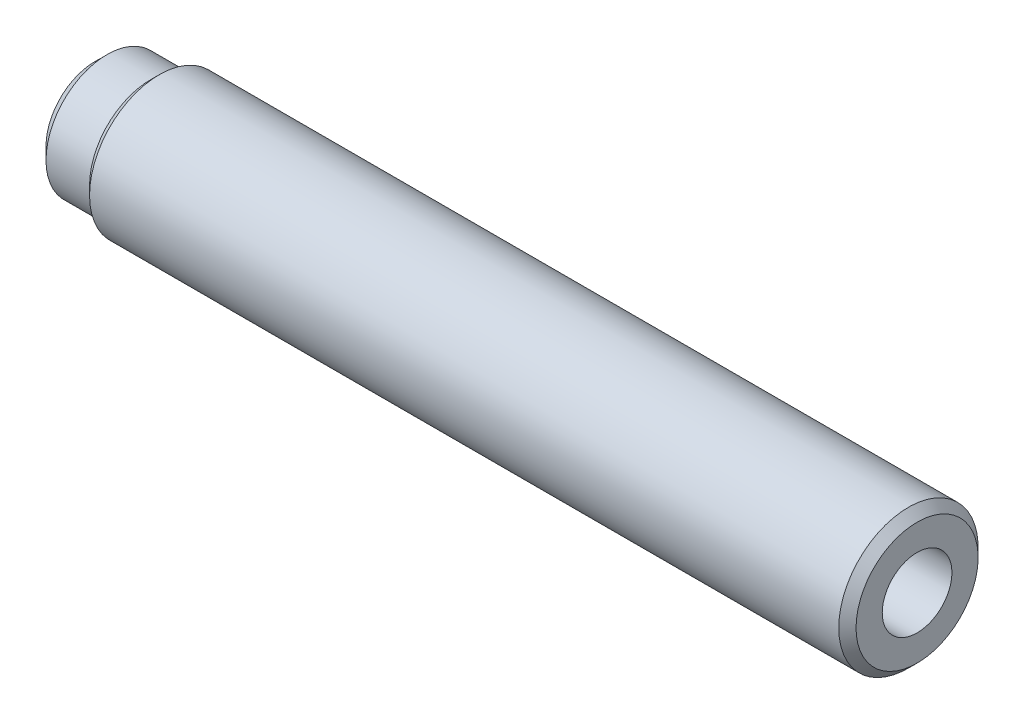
ISO-10303-21;
HEADER;
FILE_DESCRIPTION(('STEP AP214'),'2;1');
FILE_NAME('part.step','',(''),(''),'','','');
FILE_SCHEMA(('AUTOMOTIVE_DESIGN { 1 0 10303 214 1 1 1 1 }'));
ENDSEC;
DATA;
#1=APPLICATION_CONTEXT('core data for automotive mechanical design processes');
#2=APPLICATION_PROTOCOL_DEFINITION('international standard','automotive_design',2000,#1);
#3=PRODUCT_CONTEXT('',#1,'mechanical');
#4=PRODUCT('Part','Part','',(#3));
#5=PRODUCT_RELATED_PRODUCT_CATEGORY('part','',(#4));
#6=PRODUCT_DEFINITION_FORMATION('','',#4);
#7=PRODUCT_DEFINITION_CONTEXT('part definition',#1,'design');
#8=PRODUCT_DEFINITION('design','',#6,#7);
#9=PRODUCT_DEFINITION_SHAPE('','',#8);
#10=(LENGTH_UNIT() NAMED_UNIT(*) SI_UNIT(.MILLI.,.METRE.));
#11=(NAMED_UNIT(*) PLANE_ANGLE_UNIT() SI_UNIT($,.RADIAN.));
#12=(NAMED_UNIT(*) SI_UNIT($,.STERADIAN.) SOLID_ANGLE_UNIT());
#13=UNCERTAINTY_MEASURE_WITH_UNIT(LENGTH_MEASURE(1.E-05),#10,'distance_accuracy_value','');
#14=(GEOMETRIC_REPRESENTATION_CONTEXT(3) GLOBAL_UNCERTAINTY_ASSIGNED_CONTEXT((#13)) GLOBAL_UNIT_ASSIGNED_CONTEXT((#10,
#11,#12)) REPRESENTATION_CONTEXT('',''));
#15=CARTESIAN_POINT('',(0.,0.,0.));
#16=DIRECTION('',(0.,0.,1.));
#17=DIRECTION('',(1.,0.,0.));
#18=AXIS2_PLACEMENT_3D('',#15,#16,#17);
#19=CARTESIAN_POINT('',(-74.93,0.,0.));
#20=DIRECTION('',(1.,0.,0.));
#21=DIRECTION('',(0.,0.,-1.));
#22=AXIS2_PLACEMENT_3D('',#19,#20,#21);
#23=PLANE('',#22);
#24=CARTESIAN_POINT('',(-74.93,0.,0.));
#25=DIRECTION('',(-1.,0.,0.));
#26=DIRECTION('',(0.,0.,1.));
#27=AXIS2_PLACEMENT_3D('',#24,#25,#26);
#28=CIRCLE('',#27,4.45008);
#29=CARTESIAN_POINT('',(-74.93,0.,4.45008));
#30=VERTEX_POINT('',#29);
#31=EDGE_CURVE('E10',#30,#30,#28,.T.);
#32=ORIENTED_EDGE('',*,*,#31,.T.);
#33=EDGE_LOOP('',(#32));
#34=FACE_BOUND('',#33,.T.);
#35=ADVANCED_FACE('F31',(#34),#23,.F.);
#36=CARTESIAN_POINT('',(-73.81748,0.,0.));
#37=DIRECTION('',(1.,0.,0.));
#38=DIRECTION('',(0.,0.,-1.));
#39=AXIS2_PLACEMENT_3D('',#36,#37,#38);
#40=CONICAL_SURFACE('',#39,5.5626,0.785398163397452);
#41=ORIENTED_EDGE('',*,*,#31,.F.);
#42=EDGE_LOOP('',(#41));
#43=FACE_BOUND('',#42,.T.);
#44=CARTESIAN_POINT('',(-73.81748,0.,0.));
#45=DIRECTION('',(-1.,0.,0.));
#46=DIRECTION('',(0.,0.,1.));
#47=AXIS2_PLACEMENT_3D('',#44,#45,#46);
#48=CIRCLE('',#47,5.5626);
#49=CARTESIAN_POINT('',(-73.81748,0.,5.5626));
#50=VERTEX_POINT('',#49);
#51=EDGE_CURVE('E37',#50,#50,#48,.T.);
#52=ORIENTED_EDGE('',*,*,#51,.T.);
#53=EDGE_LOOP('',(#52));
#54=FACE_BOUND('',#53,.T.);
#55=ADVANCED_FACE('F75',(#43,#54),#40,.T.);
#56=CARTESIAN_POINT('',(0.,0.,0.));
#57=DIRECTION('',(-1.,0.,0.));
#58=DIRECTION('',(0.,0.,1.));
#59=AXIS2_PLACEMENT_3D('',#56,#57,#58);
#60=CYLINDRICAL_SURFACE('',#59,5.5626);
#61=ORIENTED_EDGE('',*,*,#51,.F.);
#62=EDGE_LOOP('',(#61));
#63=FACE_BOUND('',#62,.T.);
#64=CARTESIAN_POINT('',(-69.85,0.,0.));
#65=DIRECTION('',(-1.,0.,0.));
#66=DIRECTION('',(0.,0.,1.));
#67=AXIS2_PLACEMENT_3D('',#64,#65,#66);
#68=CIRCLE('',#67,5.5626);
#69=CARTESIAN_POINT('',(-69.85,0.,5.5626));
#70=VERTEX_POINT('',#69);
#71=EDGE_CURVE('E41',#70,#70,#68,.T.);
#72=ORIENTED_EDGE('',*,*,#71,.T.);
#73=EDGE_LOOP('',(#72));
#74=FACE_BOUND('',#73,.T.);
#75=ADVANCED_FACE('F79',(#63,#74),#60,.T.);
#76=CARTESIAN_POINT('',(-69.0626,0.,0.));
#77=DIRECTION('',(1.,0.,0.));
#78=DIRECTION('',(0.,0.,-1.));
#79=AXIS2_PLACEMENT_3D('',#76,#77,#78);
#80=CONICAL_SURFACE('',#79,6.35,0.785398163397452);
#81=ORIENTED_EDGE('',*,*,#71,.F.);
#82=EDGE_LOOP('',(#81));
#83=FACE_BOUND('',#82,.T.);
#84=CARTESIAN_POINT('',(-69.0626,0.,0.));
#85=DIRECTION('',(-1.,0.,0.));
#86=DIRECTION('',(0.,0.,1.));
#87=AXIS2_PLACEMENT_3D('',#84,#85,#86);
#88=CIRCLE('',#87,6.35);
#89=CARTESIAN_POINT('',(-69.0626,0.,6.35));
#90=VERTEX_POINT('',#89);
#91=EDGE_CURVE('E45',#90,#90,#88,.T.);
#92=ORIENTED_EDGE('',*,*,#91,.T.);
#93=EDGE_LOOP('',(#92));
#94=FACE_BOUND('',#93,.T.);
#95=ADVANCED_FACE('F84',(#83,#94),#80,.T.);
#96=CARTESIAN_POINT('',(0.,0.,0.));
#97=DIRECTION('',(-1.,0.,0.));
#98=DIRECTION('',(0.,0.,1.));
#99=AXIS2_PLACEMENT_3D('',#96,#97,#98);
#100=CYLINDRICAL_SURFACE('',#99,6.35);
#101=ORIENTED_EDGE('',*,*,#91,.F.);
#102=EDGE_LOOP('',(#101));
#103=FACE_BOUND('',#102,.T.);
#104=CARTESIAN_POINT('',(-0.7874,0.,0.));
#105=DIRECTION('',(-1.,0.,0.));
#106=DIRECTION('',(0.,0.,1.));
#107=AXIS2_PLACEMENT_3D('',#104,#105,#106);
#108=CIRCLE('',#107,6.35);
#109=CARTESIAN_POINT('',(-0.7874,0.,6.35));
#110=VERTEX_POINT('',#109);
#111=EDGE_CURVE('E50',#110,#110,#108,.T.);
#112=ORIENTED_EDGE('',*,*,#111,.T.);
#113=EDGE_LOOP('',(#112));
#114=FACE_BOUND('',#113,.T.);
#115=ADVANCED_FACE('F90',(#103,#114),#100,.T.);
#116=CARTESIAN_POINT('',(0.,0.,0.));
#117=DIRECTION('',(-1.,0.,0.));
#118=DIRECTION('',(0.,0.,1.));
#119=AXIS2_PLACEMENT_3D('',#116,#117,#118);
#120=CONICAL_SURFACE('',#119,5.5626,0.785398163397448);
#121=ORIENTED_EDGE('',*,*,#111,.F.);
#122=EDGE_LOOP('',(#121));
#123=FACE_BOUND('',#122,.T.);
#124=CARTESIAN_POINT('',(0.,0.,0.));
#125=DIRECTION('',(-1.,0.,0.));
#126=DIRECTION('',(0.,0.,1.));
#127=AXIS2_PLACEMENT_3D('',#124,#125,#126);
#128=CIRCLE('',#127,5.5626);
#129=CARTESIAN_POINT('',(0.,0.,5.5626));
#130=VERTEX_POINT('',#129);
#131=EDGE_CURVE('E53',#130,#130,#128,.T.);
#132=ORIENTED_EDGE('',*,*,#131,.T.);
#133=EDGE_LOOP('',(#132));
#134=FACE_BOUND('',#133,.T.);
#135=ADVANCED_FACE('F94',(#123,#134),#120,.T.);
#136=CARTESIAN_POINT('',(0.,5.5626,0.));
#137=DIRECTION('',(-1.,0.,0.));
#138=DIRECTION('',(0.,0.,1.));
#139=AXIS2_PLACEMENT_3D('',#136,#137,#138);
#140=PLANE('',#139);
#141=ORIENTED_EDGE('',*,*,#131,.F.);
#142=EDGE_LOOP('',(#141));
#143=FACE_BOUND('',#142,.T.);
#144=CARTESIAN_POINT('',(0.,0.,0.));
#145=DIRECTION('',(-1.,0.,0.));
#146=DIRECTION('',(0.,0.,1.));
#147=AXIS2_PLACEMENT_3D('',#144,#145,#146);
#148=CIRCLE('',#147,3.175);
#149=CARTESIAN_POINT('',(0.,0.,3.175));
#150=VERTEX_POINT('',#149);
#151=EDGE_CURVE('E56',#150,#150,#148,.T.);
#152=ORIENTED_EDGE('',*,*,#151,.T.);
#153=EDGE_LOOP('',(#152));
#154=FACE_BOUND('',#153,.T.);
#155=ADVANCED_FACE('F71',(#143,#154),#140,.F.);
#156=CARTESIAN_POINT('',(0.,0.,0.));
#157=DIRECTION('',(-1.,0.,0.));
#158=DIRECTION('',(0.,0.,1.));
#159=AXIS2_PLACEMENT_3D('',#156,#157,#158);
#160=CYLINDRICAL_SURFACE('',#159,3.175);
#161=ORIENTED_EDGE('',*,*,#151,.F.);
#162=EDGE_LOOP('',(#161));
#163=FACE_BOUND('',#162,.T.);
#164=CARTESIAN_POINT('',(-21.59,0.,0.));
#165=DIRECTION('',(-1.,0.,0.));
#166=DIRECTION('',(0.,0.,1.));
#167=AXIS2_PLACEMENT_3D('',#164,#165,#166);
#168=CIRCLE('',#167,3.175);
#169=CARTESIAN_POINT('',(-21.59,0.,3.175));
#170=VERTEX_POINT('',#169);
#171=EDGE_CURVE('E59',#170,#170,#168,.T.);
#172=ORIENTED_EDGE('',*,*,#171,.T.);
#173=EDGE_LOOP('',(#172));
#174=FACE_BOUND('',#173,.T.);
#175=ADVANCED_FACE('F63',(#163,#174),#160,.F.);
#176=CARTESIAN_POINT('',(-21.59,3.175,0.));
#177=DIRECTION('',(-1.,0.,0.));
#178=DIRECTION('',(0.,0.,1.));
#179=AXIS2_PLACEMENT_3D('',#176,#177,#178);
#180=PLANE('',#179);
#181=ORIENTED_EDGE('',*,*,#171,.F.);
#182=EDGE_LOOP('',(#181));
#183=FACE_BOUND('',#182,.T.);
#184=ADVANCED_FACE('F65',(#183),#180,.F.);
#185=CLOSED_SHELL('',(#35,#55,#75,#95,#115,#135,#155,#175,#184));
#186=MANIFOLD_SOLID_BREP('B2',#185);
#187=ADVANCED_BREP_SHAPE_REPRESENTATION('',(#18,#186),#14);
#188=SHAPE_DEFINITION_REPRESENTATION(#9,#187);
ENDSEC;
END-ISO-10303-21;
